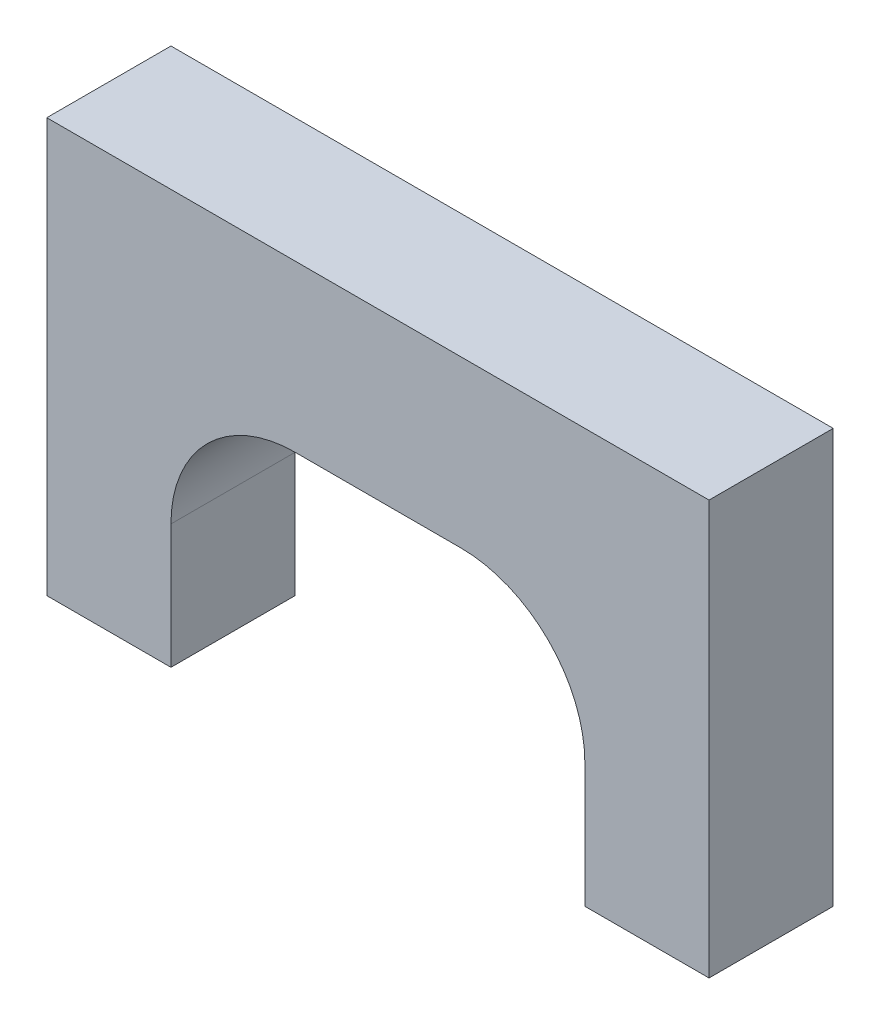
ISO-10303-21;
HEADER;
FILE_DESCRIPTION(('STEP AP214'),'2;1');
FILE_NAME('part.step','',(''),(''),'','','');
FILE_SCHEMA(('AUTOMOTIVE_DESIGN { 1 0 10303 214 1 1 1 1 }'));
ENDSEC;
DATA;
#1=APPLICATION_CONTEXT('core data for automotive mechanical design processes');
#2=APPLICATION_PROTOCOL_DEFINITION('international standard','automotive_design',2000,#1);
#3=PRODUCT_CONTEXT('',#1,'mechanical');
#4=PRODUCT('Part','Part','',(#3));
#5=PRODUCT_RELATED_PRODUCT_CATEGORY('part','',(#4));
#6=PRODUCT_DEFINITION_FORMATION('','',#4);
#7=PRODUCT_DEFINITION_CONTEXT('part definition',#1,'design');
#8=PRODUCT_DEFINITION('design','',#6,#7);
#9=PRODUCT_DEFINITION_SHAPE('','',#8);
#10=(LENGTH_UNIT() NAMED_UNIT(*) SI_UNIT(.MILLI.,.METRE.));
#11=(NAMED_UNIT(*) PLANE_ANGLE_UNIT() SI_UNIT($,.RADIAN.));
#12=(NAMED_UNIT(*) SI_UNIT($,.STERADIAN.) SOLID_ANGLE_UNIT());
#13=UNCERTAINTY_MEASURE_WITH_UNIT(LENGTH_MEASURE(1.E-05),#10,'distance_accuracy_value','');
#14=(GEOMETRIC_REPRESENTATION_CONTEXT(3) GLOBAL_UNCERTAINTY_ASSIGNED_CONTEXT((#13)) GLOBAL_UNIT_ASSIGNED_CONTEXT((#10,
#11,#12)) REPRESENTATION_CONTEXT('',''));
#15=CARTESIAN_POINT('',(0.,0.,0.));
#16=DIRECTION('',(0.,0.,1.));
#17=DIRECTION('',(1.,0.,0.));
#18=AXIS2_PLACEMENT_3D('',#15,#16,#17);
#19=CARTESIAN_POINT('',(-8.,-5.,3.));
#20=DIRECTION('',(0.,1.,0.));
#21=DIRECTION('',(0.,0.,1.));
#22=AXIS2_PLACEMENT_3D('',#19,#20,#21);
#23=PLANE('',#22);
#24=DIRECTION('',(1.,0.,0.));
#25=VECTOR('',#24,1.);
#26=CARTESIAN_POINT('',(-8.,-5.,3.));
#27=LINE('',#26,#25);
#28=CARTESIAN_POINT('',(5.,-5.,3.));
#29=VERTEX_POINT('',#28);
#30=CARTESIAN_POINT('',(8.,-5.,3.));
#31=VERTEX_POINT('',#30);
#32=EDGE_CURVE('E139',#29,#31,#27,.T.);
#33=ORIENTED_EDGE('',*,*,#32,.F.);
#34=DIRECTION('',(0.,0.,-1.));
#35=VECTOR('',#34,1.);
#36=CARTESIAN_POINT('',(5.,-5.,3.));
#37=LINE('',#36,#35);
#38=CARTESIAN_POINT('',(5.,-5.,0.));
#39=VERTEX_POINT('',#38);
#40=EDGE_CURVE('E131',#29,#39,#37,.T.);
#41=ORIENTED_EDGE('',*,*,#40,.T.);
#42=DIRECTION('',(1.,0.,0.));
#43=VECTOR('',#42,1.);
#44=CARTESIAN_POINT('',(-8.,-5.,0.));
#45=LINE('',#44,#43);
#46=CARTESIAN_POINT('',(8.,-5.,0.));
#47=VERTEX_POINT('',#46);
#48=EDGE_CURVE('E154',#39,#47,#45,.T.);
#49=ORIENTED_EDGE('',*,*,#48,.T.);
#50=DIRECTION('',(0.,0.,-1.));
#51=VECTOR('',#50,1.);
#52=CARTESIAN_POINT('',(8.,-5.,3.));
#53=LINE('',#52,#51);
#54=EDGE_CURVE('E138',#31,#47,#53,.T.);
#55=ORIENTED_EDGE('',*,*,#54,.F.);
#56=EDGE_LOOP('',(#33,#41,#49,#55));
#57=FACE_BOUND('',#56,.T.);
#58=ADVANCED_FACE('F35',(#57),#23,.F.);
#59=CARTESIAN_POINT('',(8.,5.,3.));
#60=DIRECTION('',(-1.,0.,0.));
#61=DIRECTION('',(0.,0.,1.));
#62=AXIS2_PLACEMENT_3D('',#59,#60,#61);
#63=PLANE('',#62);
#64=DIRECTION('',(0.,1.,0.));
#65=VECTOR('',#64,1.);
#66=CARTESIAN_POINT('',(8.,5.,0.));
#67=LINE('',#66,#65);
#68=CARTESIAN_POINT('',(8.,5.,0.));
#69=VERTEX_POINT('',#68);
#70=EDGE_CURVE('E147',#47,#69,#67,.T.);
#71=ORIENTED_EDGE('',*,*,#70,.T.);
#72=DIRECTION('',(0.,0.,-1.));
#73=VECTOR('',#72,1.);
#74=CARTESIAN_POINT('',(8.,5.,3.));
#75=LINE('',#74,#73);
#76=CARTESIAN_POINT('',(8.,5.,3.));
#77=VERTEX_POINT('',#76);
#78=EDGE_CURVE('E161',#77,#69,#75,.T.);
#79=ORIENTED_EDGE('',*,*,#78,.F.);
#80=DIRECTION('',(0.,1.,0.));
#81=VECTOR('',#80,1.);
#82=CARTESIAN_POINT('',(8.,5.,3.));
#83=LINE('',#82,#81);
#84=EDGE_CURVE('E155',#31,#77,#83,.T.);
#85=ORIENTED_EDGE('',*,*,#84,.F.);
#86=ORIENTED_EDGE('',*,*,#54,.T.);
#87=EDGE_LOOP('',(#71,#79,#85,#86));
#88=FACE_BOUND('',#87,.T.);
#89=ADVANCED_FACE('F208',(#88),#63,.F.);
#90=CARTESIAN_POINT('',(-8.,5.,3.));
#91=DIRECTION('',(0.,-1.,0.));
#92=DIRECTION('',(0.,0.,-1.));
#93=AXIS2_PLACEMENT_3D('',#90,#91,#92);
#94=PLANE('',#93);
#95=DIRECTION('',(-1.,0.,0.));
#96=VECTOR('',#95,1.);
#97=CARTESIAN_POINT('',(-8.,5.,0.));
#98=LINE('',#97,#96);
#99=CARTESIAN_POINT('',(-8.,5.,0.));
#100=VERTEX_POINT('',#99);
#101=EDGE_CURVE('E150',#69,#100,#98,.T.);
#102=ORIENTED_EDGE('',*,*,#101,.T.);
#103=DIRECTION('',(0.,0.,-1.));
#104=VECTOR('',#103,1.);
#105=CARTESIAN_POINT('',(-8.,5.,3.));
#106=LINE('',#105,#104);
#107=CARTESIAN_POINT('',(-8.,5.,3.));
#108=VERTEX_POINT('',#107);
#109=EDGE_CURVE('E158',#108,#100,#106,.T.);
#110=ORIENTED_EDGE('',*,*,#109,.F.);
#111=DIRECTION('',(-1.,0.,0.));
#112=VECTOR('',#111,1.);
#113=CARTESIAN_POINT('',(-8.,5.,3.));
#114=LINE('',#113,#112);
#115=EDGE_CURVE('E197',#77,#108,#114,.T.);
#116=ORIENTED_EDGE('',*,*,#115,.F.);
#117=ORIENTED_EDGE('',*,*,#78,.T.);
#118=EDGE_LOOP('',(#102,#110,#116,#117));
#119=FACE_BOUND('',#118,.T.);
#120=ADVANCED_FACE('F202',(#119),#94,.F.);
#121=CARTESIAN_POINT('',(-8.,5.,3.));
#122=DIRECTION('',(1.,0.,0.));
#123=DIRECTION('',(0.,1.,0.));
#124=AXIS2_PLACEMENT_3D('',#121,#122,#123);
#125=PLANE('',#124);
#126=DIRECTION('',(0.,-1.,0.));
#127=VECTOR('',#126,1.);
#128=CARTESIAN_POINT('',(-8.,5.,0.));
#129=LINE('',#128,#127);
#130=CARTESIAN_POINT('',(-8.,-5.,0.));
#131=VERTEX_POINT('',#130);
#132=EDGE_CURVE('E152',#100,#131,#129,.T.);
#133=ORIENTED_EDGE('',*,*,#132,.T.);
#134=DIRECTION('',(0.,0.,-1.));
#135=VECTOR('',#134,1.);
#136=CARTESIAN_POINT('',(-8.,-5.,3.));
#137=LINE('',#136,#135);
#138=CARTESIAN_POINT('',(-8.,-5.,3.));
#139=VERTEX_POINT('',#138);
#140=EDGE_CURVE('E142',#139,#131,#137,.T.);
#141=ORIENTED_EDGE('',*,*,#140,.F.);
#142=DIRECTION('',(0.,-1.,0.));
#143=VECTOR('',#142,1.);
#144=CARTESIAN_POINT('',(-8.,5.,3.));
#145=LINE('',#144,#143);
#146=EDGE_CURVE('E136',#108,#139,#145,.T.);
#147=ORIENTED_EDGE('',*,*,#146,.F.);
#148=ORIENTED_EDGE('',*,*,#109,.T.);
#149=EDGE_LOOP('',(#133,#141,#147,#148));
#150=FACE_BOUND('',#149,.T.);
#151=ADVANCED_FACE('F205',(#150),#125,.F.);
#152=CARTESIAN_POINT('',(-5.,-5.,0.));
#153=VERTEX_POINT('',#152);
#154=EDGE_CURVE('E130',#131,#153,#45,.T.);
#155=ORIENTED_EDGE('',*,*,#154,.T.);
#156=DIRECTION('',(0.,0.,1.));
#157=VECTOR('',#156,1.);
#158=CARTESIAN_POINT('',(-5.,-5.,3.));
#159=LINE('',#158,#157);
#160=CARTESIAN_POINT('',(-5.,-5.,3.));
#161=VERTEX_POINT('',#160);
#162=EDGE_CURVE('E116',#153,#161,#159,.T.);
#163=ORIENTED_EDGE('',*,*,#162,.T.);
#164=EDGE_CURVE('E128',#139,#161,#27,.T.);
#165=ORIENTED_EDGE('',*,*,#164,.F.);
#166=ORIENTED_EDGE('',*,*,#140,.T.);
#167=EDGE_LOOP('',(#155,#163,#165,#166));
#168=FACE_BOUND('',#167,.T.);
#169=ADVANCED_FACE('F126',(#168),#23,.F.);
#170=CARTESIAN_POINT('',(0.,0.,3.));
#171=DIRECTION('',(0.,0.,1.));
#172=DIRECTION('',(1.,0.,0.));
#173=AXIS2_PLACEMENT_3D('',#170,#171,#172);
#174=PLANE('',#173);
#175=DIRECTION('',(0.,1.,0.));
#176=VECTOR('',#175,1.);
#177=CARTESIAN_POINT('',(5.,-11.,3.));
#178=LINE('',#177,#176);
#179=CARTESIAN_POINT('',(5.,-2.,3.));
#180=VERTEX_POINT('',#179);
#181=EDGE_CURVE('E190',#29,#180,#178,.T.);
#182=ORIENTED_EDGE('',*,*,#181,.F.);
#183=ORIENTED_EDGE('',*,*,#32,.T.);
#184=ORIENTED_EDGE('',*,*,#84,.T.);
#185=ORIENTED_EDGE('',*,*,#115,.T.);
#186=ORIENTED_EDGE('',*,*,#146,.T.);
#187=ORIENTED_EDGE('',*,*,#164,.T.);
#188=DIRECTION('',(0.,-1.,0.));
#189=VECTOR('',#188,1.);
#190=CARTESIAN_POINT('',(-5.,-11.,3.));
#191=LINE('',#190,#189);
#192=CARTESIAN_POINT('',(-5.,-2.,3.));
#193=VERTEX_POINT('',#192);
#194=EDGE_CURVE('E112',#193,#161,#191,.T.);
#195=ORIENTED_EDGE('',*,*,#194,.F.);
#196=CARTESIAN_POINT('',(-2.,-2.,3.));
#197=DIRECTION('',(0.,0.,1.));
#198=DIRECTION('',(1.,0.,0.));
#199=AXIS2_PLACEMENT_3D('',#196,#197,#198);
#200=CIRCLE('',#199,3.);
#201=CARTESIAN_POINT('',(-2.,1.,3.));
#202=VERTEX_POINT('',#201);
#203=EDGE_CURVE('E173',#193,#202,#200,.F.);
#204=ORIENTED_EDGE('',*,*,#203,.T.);
#205=DIRECTION('',(-1.,0.,0.));
#206=VECTOR('',#205,1.);
#207=CARTESIAN_POINT('',(-5.,1.,3.));
#208=LINE('',#207,#206);
#209=CARTESIAN_POINT('',(2.,1.,3.));
#210=VERTEX_POINT('',#209);
#211=EDGE_CURVE('E122',#210,#202,#208,.T.);
#212=ORIENTED_EDGE('',*,*,#211,.F.);
#213=CARTESIAN_POINT('',(2.,-2.,3.));
#214=DIRECTION('',(0.,0.,1.));
#215=DIRECTION('',(1.,0.,0.));
#216=AXIS2_PLACEMENT_3D('',#213,#214,#215);
#217=CIRCLE('',#216,3.);
#218=EDGE_CURVE('E43',#210,#180,#217,.F.);
#219=ORIENTED_EDGE('',*,*,#218,.T.);
#220=EDGE_LOOP('',(#182,#183,#184,#185,#186,#187,#195,#204,#212,#219));
#221=FACE_BOUND('',#220,.T.);
#222=ADVANCED_FACE('F134',(#221),#174,.T.);
#223=CARTESIAN_POINT('',(0.,0.,0.));
#224=DIRECTION('',(0.,0.,1.));
#225=DIRECTION('',(1.,0.,0.));
#226=AXIS2_PLACEMENT_3D('',#223,#224,#225);
#227=PLANE('',#226);
#228=ORIENTED_EDGE('',*,*,#48,.F.);
#229=DIRECTION('',(0.,1.,0.));
#230=VECTOR('',#229,1.);
#231=CARTESIAN_POINT('',(5.,0.,0.));
#232=LINE('',#231,#230);
#233=CARTESIAN_POINT('',(5.,-2.,0.));
#234=VERTEX_POINT('',#233);
#235=EDGE_CURVE('E164',#39,#234,#232,.T.);
#236=ORIENTED_EDGE('',*,*,#235,.T.);
#237=CARTESIAN_POINT('',(2.,-2.,0.));
#238=DIRECTION('',(0.,0.,1.));
#239=DIRECTION('',(1.,0.,0.));
#240=AXIS2_PLACEMENT_3D('',#237,#238,#239);
#241=CIRCLE('',#240,3.);
#242=CARTESIAN_POINT('',(2.,1.,0.));
#243=VERTEX_POINT('',#242);
#244=EDGE_CURVE('E11',#234,#243,#241,.T.);
#245=ORIENTED_EDGE('',*,*,#244,.T.);
#246=DIRECTION('',(-1.,0.,0.));
#247=VECTOR('',#246,1.);
#248=CARTESIAN_POINT('',(-5.,1.,0.));
#249=LINE('',#248,#247);
#250=CARTESIAN_POINT('',(-2.,1.,0.));
#251=VERTEX_POINT('',#250);
#252=EDGE_CURVE('E121',#243,#251,#249,.T.);
#253=ORIENTED_EDGE('',*,*,#252,.T.);
#254=CARTESIAN_POINT('',(-2.,-2.,0.));
#255=DIRECTION('',(0.,0.,1.));
#256=DIRECTION('',(1.,0.,0.));
#257=AXIS2_PLACEMENT_3D('',#254,#255,#256);
#258=CIRCLE('',#257,3.);
#259=CARTESIAN_POINT('',(-5.,-2.,0.));
#260=VERTEX_POINT('',#259);
#261=EDGE_CURVE('E175',#251,#260,#258,.T.);
#262=ORIENTED_EDGE('',*,*,#261,.T.);
#263=DIRECTION('',(0.,-1.,0.));
#264=VECTOR('',#263,1.);
#265=CARTESIAN_POINT('',(-5.,-11.,0.));
#266=LINE('',#265,#264);
#267=EDGE_CURVE('E132',#260,#153,#266,.T.);
#268=ORIENTED_EDGE('',*,*,#267,.T.);
#269=ORIENTED_EDGE('',*,*,#154,.F.);
#270=ORIENTED_EDGE('',*,*,#132,.F.);
#271=ORIENTED_EDGE('',*,*,#101,.F.);
#272=ORIENTED_EDGE('',*,*,#70,.F.);
#273=EDGE_LOOP('',(#228,#236,#245,#253,#262,#268,#269,#270,#271,#272));
#274=FACE_BOUND('',#273,.T.);
#275=ADVANCED_FACE('F180',(#274),#227,.F.);
#276=CARTESIAN_POINT('',(5.,-11.,0.));
#277=DIRECTION('',(1.,0.,0.));
#278=DIRECTION('',(0.,1.,0.));
#279=AXIS2_PLACEMENT_3D('',#276,#277,#278);
#280=PLANE('',#279);
#281=ORIENTED_EDGE('',*,*,#181,.T.);
#282=DIRECTION('',(0.,0.,1.));
#283=VECTOR('',#282,1.);
#284=CARTESIAN_POINT('',(5.,-2.,0.));
#285=LINE('',#284,#283);
#286=EDGE_CURVE('E50',#180,#234,#285,.F.);
#287=ORIENTED_EDGE('',*,*,#286,.T.);
#288=ORIENTED_EDGE('',*,*,#235,.F.);
#289=ORIENTED_EDGE('',*,*,#40,.F.);
#290=EDGE_LOOP('',(#281,#287,#288,#289));
#291=FACE_BOUND('',#290,.T.);
#292=ADVANCED_FACE('F267',(#291),#280,.F.);
#293=CARTESIAN_POINT('',(-5.,-11.,0.));
#294=DIRECTION('',(-1.,0.,0.));
#295=DIRECTION('',(0.,-1.,0.));
#296=AXIS2_PLACEMENT_3D('',#293,#294,#295);
#297=PLANE('',#296);
#298=ORIENTED_EDGE('',*,*,#267,.F.);
#299=DIRECTION('',(0.,0.,1.));
#300=VECTOR('',#299,1.);
#301=CARTESIAN_POINT('',(-5.,-2.,3.));
#302=LINE('',#301,#300);
#303=EDGE_CURVE('E119',#260,#193,#302,.T.);
#304=ORIENTED_EDGE('',*,*,#303,.T.);
#305=ORIENTED_EDGE('',*,*,#194,.T.);
#306=ORIENTED_EDGE('',*,*,#162,.F.);
#307=EDGE_LOOP('',(#298,#304,#305,#306));
#308=FACE_BOUND('',#307,.T.);
#309=ADVANCED_FACE('F115',(#308),#297,.F.);
#310=CARTESIAN_POINT('',(-5.,1.,0.));
#311=DIRECTION('',(0.,1.,0.));
#312=DIRECTION('',(-1.,0.,0.));
#313=AXIS2_PLACEMENT_3D('',#310,#311,#312);
#314=PLANE('',#313);
#315=ORIENTED_EDGE('',*,*,#211,.T.);
#316=DIRECTION('',(0.,0.,1.));
#317=VECTOR('',#316,1.);
#318=CARTESIAN_POINT('',(-2.,1.,0.));
#319=LINE('',#318,#317);
#320=EDGE_CURVE('E170',#202,#251,#319,.F.);
#321=ORIENTED_EDGE('',*,*,#320,.T.);
#322=ORIENTED_EDGE('',*,*,#252,.F.);
#323=DIRECTION('',(0.,0.,1.));
#324=VECTOR('',#323,1.);
#325=CARTESIAN_POINT('',(2.,1.,3.));
#326=LINE('',#325,#324);
#327=EDGE_CURVE('E167',#243,#210,#326,.T.);
#328=ORIENTED_EDGE('',*,*,#327,.T.);
#329=EDGE_LOOP('',(#315,#321,#322,#328));
#330=FACE_BOUND('',#329,.T.);
#331=ADVANCED_FACE('F188',(#330),#314,.F.);
#332=CARTESIAN_POINT('',(-2.,-2.,0.));
#333=DIRECTION('',(0.,0.,-1.));
#334=DIRECTION('',(-1.,0.,0.));
#335=AXIS2_PLACEMENT_3D('',#332,#333,#334);
#336=CYLINDRICAL_SURFACE('',#335,3.);
#337=ORIENTED_EDGE('',*,*,#261,.F.);
#338=ORIENTED_EDGE('',*,*,#320,.F.);
#339=ORIENTED_EDGE('',*,*,#203,.F.);
#340=ORIENTED_EDGE('',*,*,#303,.F.);
#341=EDGE_LOOP('',(#337,#338,#339,#340));
#342=FACE_BOUND('',#341,.T.);
#343=ADVANCED_FACE('F185',(#342),#336,.F.);
#344=CARTESIAN_POINT('',(2.,-2.,0.));
#345=DIRECTION('',(0.,0.,-1.));
#346=DIRECTION('',(-1.,0.,0.));
#347=AXIS2_PLACEMENT_3D('',#344,#345,#346);
#348=CYLINDRICAL_SURFACE('',#347,3.);
#349=ORIENTED_EDGE('',*,*,#244,.F.);
#350=ORIENTED_EDGE('',*,*,#286,.F.);
#351=ORIENTED_EDGE('',*,*,#218,.F.);
#352=ORIENTED_EDGE('',*,*,#327,.F.);
#353=EDGE_LOOP('',(#349,#350,#351,#352));
#354=FACE_BOUND('',#353,.T.);
#355=ADVANCED_FACE('F37',(#354),#348,.F.);
#356=CLOSED_SHELL('',(#58,#89,#120,#151,#169,#222,#275,#292,#309,#331,#343,#355));
#357=MANIFOLD_SOLID_BREP('B2',#356);
#358=ADVANCED_BREP_SHAPE_REPRESENTATION('',(#18,#357),#14);
#359=SHAPE_DEFINITION_REPRESENTATION(#9,#358);
ENDSEC;
END-ISO-10303-21;
